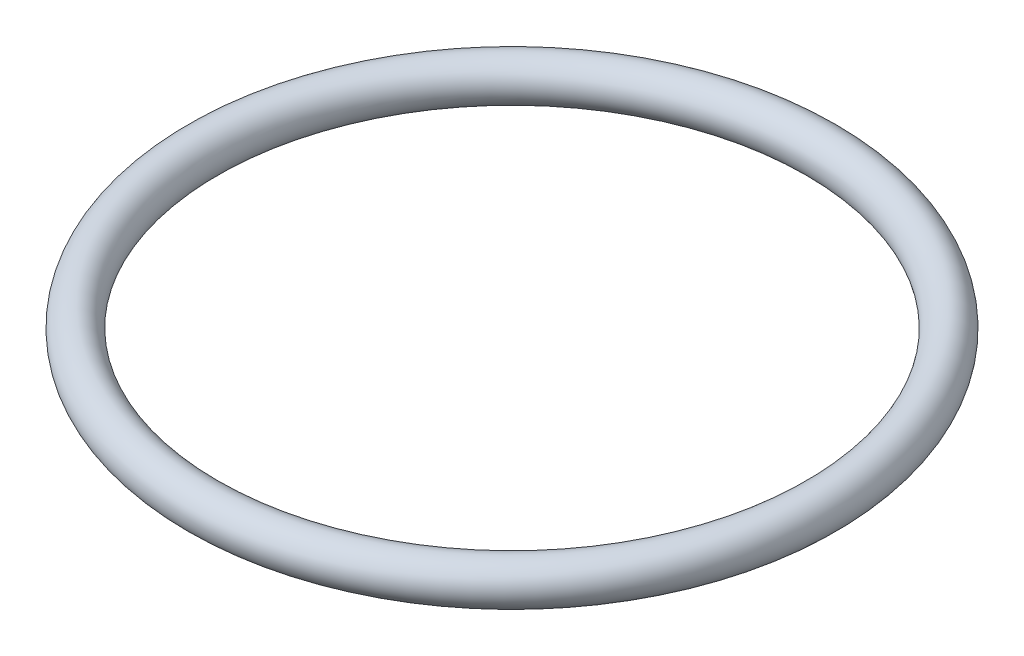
ISO-10303-21;
HEADER;
FILE_DESCRIPTION(('STEP AP214'),'2;1');
FILE_NAME('part.step','',(''),(''),'','','');
FILE_SCHEMA(('AUTOMOTIVE_DESIGN { 1 0 10303 214 1 1 1 1 }'));
ENDSEC;
DATA;
#1=APPLICATION_CONTEXT('core data for automotive mechanical design processes');
#2=APPLICATION_PROTOCOL_DEFINITION('international standard','automotive_design',2000,#1);
#3=PRODUCT_CONTEXT('',#1,'mechanical');
#4=PRODUCT('Part','Part','',(#3));
#5=PRODUCT_RELATED_PRODUCT_CATEGORY('part','',(#4));
#6=PRODUCT_DEFINITION_FORMATION('','',#4);
#7=PRODUCT_DEFINITION_CONTEXT('part definition',#1,'design');
#8=PRODUCT_DEFINITION('design','',#6,#7);
#9=PRODUCT_DEFINITION_SHAPE('','',#8);
#10=(LENGTH_UNIT() NAMED_UNIT(*) SI_UNIT(.MILLI.,.METRE.));
#11=(NAMED_UNIT(*) PLANE_ANGLE_UNIT() SI_UNIT($,.RADIAN.));
#12=(NAMED_UNIT(*) SI_UNIT($,.STERADIAN.) SOLID_ANGLE_UNIT());
#13=UNCERTAINTY_MEASURE_WITH_UNIT(LENGTH_MEASURE(1.E-05),#10,'distance_accuracy_value','');
#14=(GEOMETRIC_REPRESENTATION_CONTEXT(3) GLOBAL_UNCERTAINTY_ASSIGNED_CONTEXT((#13)) GLOBAL_UNIT_ASSIGNED_CONTEXT((#10,
#11,#12)) REPRESENTATION_CONTEXT('',''));
#15=CARTESIAN_POINT('',(0.,0.,0.));
#16=DIRECTION('',(0.,0.,1.));
#17=DIRECTION('',(1.,0.,0.));
#18=AXIS2_PLACEMENT_3D('',#15,#16,#17);
#19=CARTESIAN_POINT('',(0.,0.,0.));
#20=DIRECTION('',(0.,-1.,0.));
#21=DIRECTION('',(0.,0.,-1.));
#22=AXIS2_PLACEMENT_3D('',#19,#20,#21);
#23=TOROIDAL_SURFACE('',#22,13.208,0.889);
#24=CARTESIAN_POINT('',(0.,0.,-14.097));
#25=VERTEX_POINT('',#24);
#26=VERTEX_LOOP('',#25);
#27=FACE_BOUND('',#26,.T.);
#28=ADVANCED_FACE('F26',(#27),#23,.T.);
#29=CLOSED_SHELL('',(#28));
#30=MANIFOLD_SOLID_BREP('B2',#29);
#31=ADVANCED_BREP_SHAPE_REPRESENTATION('',(#18,#30),#14);
#32=SHAPE_DEFINITION_REPRESENTATION(#9,#31);
ENDSEC;
END-ISO-10303-21;
